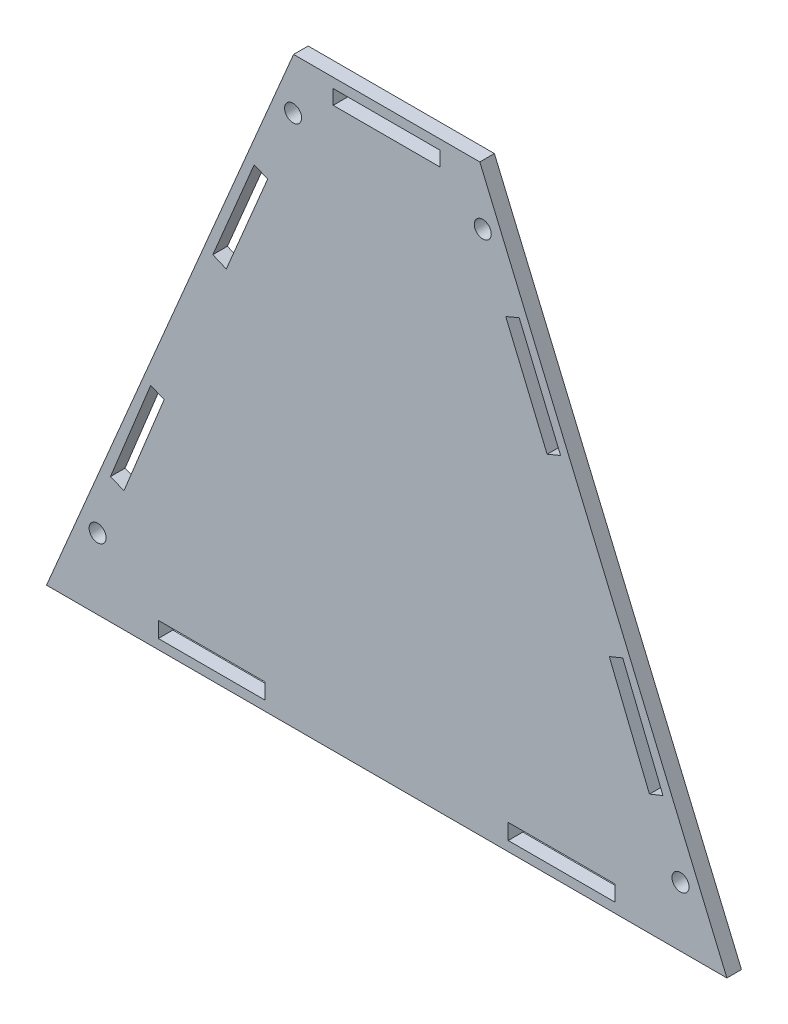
from build123d import *

# Parameters (mm, degrees)
BOSS_EXTRUDE1_DEPTH = 3
SKETCH2_R           = 1.75
CUT_EXTRUDE1_DEPTH  = 6
SKETCH4_W           = 22
SKETCH4_H           = 3.230597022
SKETCH4_H_2         = 3
CUT_EXTRUDE2_DEPTH  = 6


with BuildPart() as part:
    # Sketch1 → Boss-Extrude1 (new body)
    with BuildSketch(Plane.XY):
        Polygon((50.838897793, 53.5), (89.161102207, 53.5), (140, -66.5), (0, -66.5), align=None)
    extrude(amount=BOSS_EXTRUDE1_DEPTH)

    # Sketch2 → Cut-Extrude1 (cut)
    with BuildSketch(Plane(origin=(0, 0, 0), x_dir=(-1, 0, 0), z_dir=(0, 0, -1))):
        with Locations((-130.451332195, -54.215305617)):
            Circle(SKETCH2_R)
        with Locations((-89.764048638, 41.82285097)):
            Circle(SKETCH2_R)
        with Locations((-50.736044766, 43.00327012)):
            Circle(SKETCH2_R)
        with Locations((-10.51038589, -51.94526879)):
            Circle(SKETCH2_R)
    extrude(amount=-CUT_EXTRUDE1_DEPTH, mode=Mode.SUBTRACT)

    # Sketch4 → Cut-Extrude2 (cut)
    with BuildSketch(Plane(origin=(0, 0, 0), x_dir=(-1, 0, 0), z_dir=(0, 0, -1))):
        with Locations((-34, -62.884701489)):
            Rectangle(SKETCH4_W, SKETCH4_H)
        Polygon((-97.260814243, 29.786571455), (-105.77789756, 9.502112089), (-103.011834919, 8.340691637), (-94.494751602, 28.625151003), align=None)
        with Locations((-69.981395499, 50)):
            Rectangle(SKETCH4_W, SKETCH4_H_2)
        Polygon((-45.505248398, 28.625151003), (-36.988165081, 8.340691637), (-34.22210244, 9.502112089), (-42.739185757, 29.786571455), align=None)
        Polygon((-24.21083497, -21.314088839), (-15.936975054, -41.698966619), (-13.157218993, -40.570712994), (-21.431078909, -20.185835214), align=None)
        Polygon((-118.568921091, -20.185835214), (-115.78916503, -21.314088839), (-124.063024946, -41.698966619), (-126.842781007, -40.570712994), align=None)
        with Locations((-106, -62.884701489)):
            Rectangle(SKETCH4_W, SKETCH4_H)
    extrude(amount=-CUT_EXTRUDE2_DEPTH, mode=Mode.SUBTRACT)


solid = part.part
